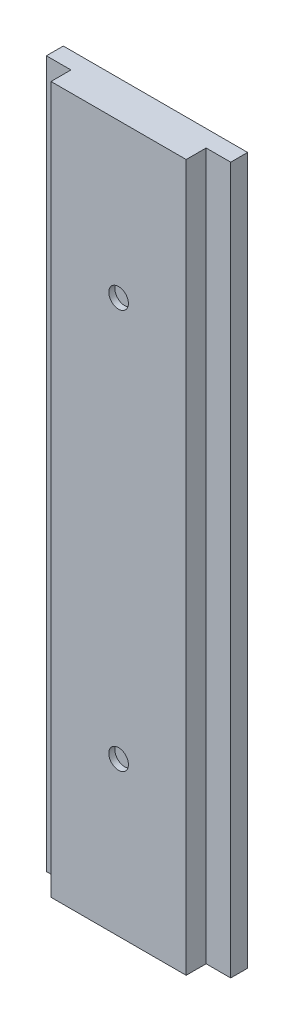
ISO-10303-21;
HEADER;
FILE_DESCRIPTION(('STEP AP214'),'2;1');
FILE_NAME('part.step','',(''),(''),'','','');
FILE_SCHEMA(('AUTOMOTIVE_DESIGN { 1 0 10303 214 1 1 1 1 }'));
ENDSEC;
DATA;
#1=APPLICATION_CONTEXT('core data for automotive mechanical design processes');
#2=APPLICATION_PROTOCOL_DEFINITION('international standard','automotive_design',2000,#1);
#3=PRODUCT_CONTEXT('',#1,'mechanical');
#4=PRODUCT('Part','Part','',(#3));
#5=PRODUCT_RELATED_PRODUCT_CATEGORY('part','',(#4));
#6=PRODUCT_DEFINITION_FORMATION('','',#4);
#7=PRODUCT_DEFINITION_CONTEXT('part definition',#1,'design');
#8=PRODUCT_DEFINITION('design','',#6,#7);
#9=PRODUCT_DEFINITION_SHAPE('','',#8);
#10=(LENGTH_UNIT() NAMED_UNIT(*) SI_UNIT(.MILLI.,.METRE.));
#11=(NAMED_UNIT(*) PLANE_ANGLE_UNIT() SI_UNIT($,.RADIAN.));
#12=(NAMED_UNIT(*) SI_UNIT($,.STERADIAN.) SOLID_ANGLE_UNIT());
#13=UNCERTAINTY_MEASURE_WITH_UNIT(LENGTH_MEASURE(1.E-05),#10,'distance_accuracy_value','');
#14=(GEOMETRIC_REPRESENTATION_CONTEXT(3) GLOBAL_UNCERTAINTY_ASSIGNED_CONTEXT((#13)) GLOBAL_UNIT_ASSIGNED_CONTEXT((#10,
#11,#12)) REPRESENTATION_CONTEXT('',''));
#15=CARTESIAN_POINT('',(0.,0.,0.));
#16=DIRECTION('',(0.,0.,1.));
#17=DIRECTION('',(1.,0.,0.));
#18=AXIS2_PLACEMENT_3D('',#15,#16,#17);
#19=CARTESIAN_POINT('',(20.,40.,6.));
#20=DIRECTION('',(1.,0.,0.));
#21=DIRECTION('',(0.,1.,0.));
#22=AXIS2_PLACEMENT_3D('',#19,#20,#21);
#23=PLANE('',#22);
#24=DIRECTION('',(0.,-1.,0.));
#25=VECTOR('',#24,1.);
#26=CARTESIAN_POINT('',(20.,40.,2.75));
#27=LINE('',#26,#25);
#28=CARTESIAN_POINT('',(20.,40.,2.75));
#29=VERTEX_POINT('',#28);
#30=CARTESIAN_POINT('',(20.,-75.,2.75));
#31=VERTEX_POINT('',#30);
#32=EDGE_CURVE('E152',#29,#31,#27,.T.);
#33=ORIENTED_EDGE('',*,*,#32,.F.);
#34=DIRECTION('',(0.,0.,-1.));
#35=VECTOR('',#34,1.);
#36=CARTESIAN_POINT('',(20.,40.,6.));
#37=LINE('',#36,#35);
#38=CARTESIAN_POINT('',(20.,40.,0.));
#39=VERTEX_POINT('',#38);
#40=EDGE_CURVE('E111',#29,#39,#37,.T.);
#41=ORIENTED_EDGE('',*,*,#40,.T.);
#42=DIRECTION('',(0.,-1.,0.));
#43=VECTOR('',#42,1.);
#44=CARTESIAN_POINT('',(20.,40.,0.));
#45=LINE('',#44,#43);
#46=CARTESIAN_POINT('',(20.,-75.,0.));
#47=VERTEX_POINT('',#46);
#48=EDGE_CURVE('E135',#39,#47,#45,.T.);
#49=ORIENTED_EDGE('',*,*,#48,.T.);
#50=DIRECTION('',(0.,0.,-1.));
#51=VECTOR('',#50,1.);
#52=CARTESIAN_POINT('',(20.,-75.,6.));
#53=LINE('',#52,#51);
#54=EDGE_CURVE('E11',#31,#47,#53,.T.);
#55=ORIENTED_EDGE('',*,*,#54,.F.);
#56=EDGE_LOOP('',(#33,#41,#49,#55));
#57=FACE_BOUND('',#56,.T.);
#58=ADVANCED_FACE('F26',(#57),#23,.F.);
#59=CARTESIAN_POINT('',(20.,-75.,6.));
#60=DIRECTION('',(0.,1.,0.));
#61=DIRECTION('',(0.,0.,1.));
#62=AXIS2_PLACEMENT_3D('',#59,#60,#61);
#63=PLANE('',#62);
#64=DIRECTION('',(1.,0.,0.));
#65=VECTOR('',#64,1.);
#66=CARTESIAN_POINT('',(50.,-75.,2.75));
#67=LINE('',#66,#65);
#68=CARTESIAN_POINT('',(46.,-75.,2.75));
#69=VERTEX_POINT('',#68);
#70=CARTESIAN_POINT('',(50.,-75.,2.75));
#71=VERTEX_POINT('',#70);
#72=EDGE_CURVE('E104',#69,#71,#67,.T.);
#73=ORIENTED_EDGE('',*,*,#72,.F.);
#74=DIRECTION('',(0.,0.,1.));
#75=VECTOR('',#74,1.);
#76=CARTESIAN_POINT('',(46.,-75.,2.75));
#77=LINE('',#76,#75);
#78=CARTESIAN_POINT('',(46.,-75.,6.));
#79=VERTEX_POINT('',#78);
#80=EDGE_CURVE('E90',#69,#79,#77,.T.);
#81=ORIENTED_EDGE('',*,*,#80,.T.);
#82=DIRECTION('',(1.,0.,0.));
#83=VECTOR('',#82,1.);
#84=CARTESIAN_POINT('',(20.,-75.,6.));
#85=LINE('',#84,#83);
#86=CARTESIAN_POINT('',(24.,-75.,6.));
#87=VERTEX_POINT('',#86);
#88=EDGE_CURVE('E102',#87,#79,#85,.T.);
#89=ORIENTED_EDGE('',*,*,#88,.F.);
#90=DIRECTION('',(0.,0.,1.));
#91=VECTOR('',#90,1.);
#92=CARTESIAN_POINT('',(24.,-75.,2.75));
#93=LINE('',#92,#91);
#94=CARTESIAN_POINT('',(24.,-75.,2.75));
#95=VERTEX_POINT('',#94);
#96=EDGE_CURVE('E48',#95,#87,#93,.T.);
#97=ORIENTED_EDGE('',*,*,#96,.F.);
#98=DIRECTION('',(1.,0.,0.));
#99=VECTOR('',#98,1.);
#100=CARTESIAN_POINT('',(20.,-75.,2.75));
#101=LINE('',#100,#99);
#102=EDGE_CURVE('E149',#31,#95,#101,.T.);
#103=ORIENTED_EDGE('',*,*,#102,.F.);
#104=ORIENTED_EDGE('',*,*,#54,.T.);
#105=DIRECTION('',(1.,0.,0.));
#106=VECTOR('',#105,1.);
#107=CARTESIAN_POINT('',(20.,-75.,0.));
#108=LINE('',#107,#106);
#109=CARTESIAN_POINT('',(50.,-75.,0.));
#110=VERTEX_POINT('',#109);
#111=EDGE_CURVE('E129',#47,#110,#108,.T.);
#112=ORIENTED_EDGE('',*,*,#111,.T.);
#113=DIRECTION('',(0.,0.,-1.));
#114=VECTOR('',#113,1.);
#115=CARTESIAN_POINT('',(50.,-75.,6.));
#116=LINE('',#115,#114);
#117=EDGE_CURVE('E33',#71,#110,#116,.T.);
#118=ORIENTED_EDGE('',*,*,#117,.F.);
#119=EDGE_LOOP('',(#73,#81,#89,#97,#103,#104,#112,#118));
#120=FACE_BOUND('',#119,.T.);
#121=ADVANCED_FACE('F101',(#120),#63,.F.);
#122=CARTESIAN_POINT('',(50.,40.,6.));
#123=DIRECTION('',(-1.,0.,0.));
#124=DIRECTION('',(0.,-1.,0.));
#125=AXIS2_PLACEMENT_3D('',#122,#123,#124);
#126=PLANE('',#125);
#127=DIRECTION('',(0.,0.,-1.));
#128=VECTOR('',#127,1.);
#129=CARTESIAN_POINT('',(50.,40.,6.));
#130=LINE('',#129,#128);
#131=CARTESIAN_POINT('',(50.,40.,2.75));
#132=VERTEX_POINT('',#131);
#133=CARTESIAN_POINT('',(50.,40.,0.));
#134=VERTEX_POINT('',#133);
#135=EDGE_CURVE('E119',#132,#134,#130,.T.);
#136=ORIENTED_EDGE('',*,*,#135,.F.);
#137=DIRECTION('',(0.,1.,0.));
#138=VECTOR('',#137,1.);
#139=CARTESIAN_POINT('',(50.,40.,2.75));
#140=LINE('',#139,#138);
#141=EDGE_CURVE('E95',#71,#132,#140,.T.);
#142=ORIENTED_EDGE('',*,*,#141,.F.);
#143=ORIENTED_EDGE('',*,*,#117,.T.);
#144=DIRECTION('',(0.,1.,0.));
#145=VECTOR('',#144,1.);
#146=CARTESIAN_POINT('',(50.,40.,0.));
#147=LINE('',#146,#145);
#148=EDGE_CURVE('E114',#110,#134,#147,.T.);
#149=ORIENTED_EDGE('',*,*,#148,.T.);
#150=EDGE_LOOP('',(#136,#142,#143,#149));
#151=FACE_BOUND('',#150,.T.);
#152=ADVANCED_FACE('F125',(#151),#126,.F.);
#153=CARTESIAN_POINT('',(20.,40.,6.));
#154=DIRECTION('',(0.,-1.,0.));
#155=DIRECTION('',(0.,0.,-1.));
#156=AXIS2_PLACEMENT_3D('',#153,#154,#155);
#157=PLANE('',#156);
#158=DIRECTION('',(-1.,0.,0.));
#159=VECTOR('',#158,1.);
#160=CARTESIAN_POINT('',(20.,40.,6.));
#161=LINE('',#160,#159);
#162=CARTESIAN_POINT('',(46.,40.,6.));
#163=VERTEX_POINT('',#162);
#164=CARTESIAN_POINT('',(24.,40.,6.));
#165=VERTEX_POINT('',#164);
#166=EDGE_CURVE('E108',#163,#165,#161,.T.);
#167=ORIENTED_EDGE('',*,*,#166,.F.);
#168=DIRECTION('',(0.,0.,1.));
#169=VECTOR('',#168,1.);
#170=CARTESIAN_POINT('',(46.,40.,2.75));
#171=LINE('',#170,#169);
#172=CARTESIAN_POINT('',(46.,40.,2.75));
#173=VERTEX_POINT('',#172);
#174=EDGE_CURVE('E40',#173,#163,#171,.T.);
#175=ORIENTED_EDGE('',*,*,#174,.F.);
#176=DIRECTION('',(-1.,0.,0.));
#177=VECTOR('',#176,1.);
#178=CARTESIAN_POINT('',(50.,40.,2.75));
#179=LINE('',#178,#177);
#180=EDGE_CURVE('E159',#132,#173,#179,.T.);
#181=ORIENTED_EDGE('',*,*,#180,.F.);
#182=ORIENTED_EDGE('',*,*,#135,.T.);
#183=DIRECTION('',(-1.,0.,0.));
#184=VECTOR('',#183,1.);
#185=CARTESIAN_POINT('',(20.,40.,0.));
#186=LINE('',#185,#184);
#187=EDGE_CURVE('E109',#134,#39,#186,.T.);
#188=ORIENTED_EDGE('',*,*,#187,.T.);
#189=ORIENTED_EDGE('',*,*,#40,.F.);
#190=DIRECTION('',(-1.,0.,0.));
#191=VECTOR('',#190,1.);
#192=CARTESIAN_POINT('',(20.,40.,2.75));
#193=LINE('',#192,#191);
#194=CARTESIAN_POINT('',(24.,40.,2.75));
#195=VERTEX_POINT('',#194);
#196=EDGE_CURVE('E142',#195,#29,#193,.T.);
#197=ORIENTED_EDGE('',*,*,#196,.F.);
#198=DIRECTION('',(0.,0.,1.));
#199=VECTOR('',#198,1.);
#200=CARTESIAN_POINT('',(24.,40.,2.75));
#201=LINE('',#200,#199);
#202=EDGE_CURVE('E140',#195,#165,#201,.T.);
#203=ORIENTED_EDGE('',*,*,#202,.T.);
#204=EDGE_LOOP('',(#167,#175,#181,#182,#188,#189,#197,#203));
#205=FACE_BOUND('',#204,.T.);
#206=ADVANCED_FACE('F179',(#205),#157,.F.);
#207=CARTESIAN_POINT('',(20.,40.,6.));
#208=DIRECTION('',(0.,0.,1.));
#209=DIRECTION('',(1.,0.,0.));
#210=AXIS2_PLACEMENT_3D('',#207,#208,#209);
#211=PLANE('',#210);
#212=CARTESIAN_POINT('',(35.,-50.,6.));
#213=DIRECTION('',(0.,0.,1.));
#214=DIRECTION('',(1.,0.,0.));
#215=AXIS2_PLACEMENT_3D('',#212,#213,#214);
#216=CIRCLE('',#215,1.6);
#217=CARTESIAN_POINT('',(36.6,-50.,6.));
#218=VERTEX_POINT('',#217);
#219=EDGE_CURVE('E171',#218,#218,#216,.T.);
#220=ORIENTED_EDGE('',*,*,#219,.F.);
#221=EDGE_LOOP('',(#220));
#222=FACE_BOUND('',#221,.T.);
#223=CARTESIAN_POINT('',(35.,15.,6.));
#224=DIRECTION('',(0.,0.,1.));
#225=DIRECTION('',(1.,0.,0.));
#226=AXIS2_PLACEMENT_3D('',#223,#224,#225);
#227=CIRCLE('',#226,1.6);
#228=CARTESIAN_POINT('',(36.6,15.,6.));
#229=VERTEX_POINT('',#228);
#230=EDGE_CURVE('E165',#229,#229,#227,.T.);
#231=ORIENTED_EDGE('',*,*,#230,.F.);
#232=EDGE_LOOP('',(#231));
#233=FACE_BOUND('',#232,.T.);
#234=DIRECTION('',(0.,-1.,0.));
#235=VECTOR('',#234,1.);
#236=CARTESIAN_POINT('',(46.,40.,6.));
#237=LINE('',#236,#235);
#238=EDGE_CURVE('E87',#163,#79,#237,.T.);
#239=ORIENTED_EDGE('',*,*,#238,.F.);
#240=ORIENTED_EDGE('',*,*,#166,.T.);
#241=DIRECTION('',(0.,1.,0.));
#242=VECTOR('',#241,1.);
#243=CARTESIAN_POINT('',(24.,40.,6.));
#244=LINE('',#243,#242);
#245=EDGE_CURVE('E105',#87,#165,#244,.T.);
#246=ORIENTED_EDGE('',*,*,#245,.F.);
#247=ORIENTED_EDGE('',*,*,#88,.T.);
#248=EDGE_LOOP('',(#239,#240,#246,#247));
#249=FACE_BOUND('',#248,.T.);
#250=ADVANCED_FACE('F107',(#222,#233,#249),#211,.T.);
#251=CARTESIAN_POINT('',(20.,40.,0.));
#252=DIRECTION('',(0.,0.,1.));
#253=DIRECTION('',(1.,0.,0.));
#254=AXIS2_PLACEMENT_3D('',#251,#252,#253);
#255=PLANE('',#254);
#256=ORIENTED_EDGE('',*,*,#48,.F.);
#257=ORIENTED_EDGE('',*,*,#187,.F.);
#258=ORIENTED_EDGE('',*,*,#148,.F.);
#259=ORIENTED_EDGE('',*,*,#111,.F.);
#260=EDGE_LOOP('',(#256,#257,#258,#259));
#261=FACE_BOUND('',#260,.T.);
#262=ADVANCED_FACE('F137',(#261),#255,.F.);
#263=CARTESIAN_POINT('',(24.,40.,2.75));
#264=DIRECTION('',(1.,0.,0.));
#265=DIRECTION('',(0.,1.,0.));
#266=AXIS2_PLACEMENT_3D('',#263,#264,#265);
#267=PLANE('',#266);
#268=ORIENTED_EDGE('',*,*,#245,.T.);
#269=ORIENTED_EDGE('',*,*,#202,.F.);
#270=DIRECTION('',(0.,1.,0.));
#271=VECTOR('',#270,1.);
#272=CARTESIAN_POINT('',(24.,40.,2.75));
#273=LINE('',#272,#271);
#274=EDGE_CURVE('E146',#95,#195,#273,.T.);
#275=ORIENTED_EDGE('',*,*,#274,.F.);
#276=ORIENTED_EDGE('',*,*,#96,.T.);
#277=EDGE_LOOP('',(#268,#269,#275,#276));
#278=FACE_BOUND('',#277,.T.);
#279=ADVANCED_FACE('F210',(#278),#267,.F.);
#280=CARTESIAN_POINT('',(20.,-75.,2.75));
#281=DIRECTION('',(0.,0.,1.));
#282=DIRECTION('',(1.,0.,0.));
#283=AXIS2_PLACEMENT_3D('',#280,#281,#282);
#284=PLANE('',#283);
#285=ORIENTED_EDGE('',*,*,#32,.T.);
#286=ORIENTED_EDGE('',*,*,#102,.T.);
#287=ORIENTED_EDGE('',*,*,#274,.T.);
#288=ORIENTED_EDGE('',*,*,#196,.T.);
#289=EDGE_LOOP('',(#285,#286,#287,#288));
#290=FACE_BOUND('',#289,.T.);
#291=ADVANCED_FACE('F211',(#290),#284,.T.);
#292=CARTESIAN_POINT('',(46.,40.,2.75));
#293=DIRECTION('',(-1.,0.,0.));
#294=DIRECTION('',(0.,-1.,0.));
#295=AXIS2_PLACEMENT_3D('',#292,#293,#294);
#296=PLANE('',#295);
#297=ORIENTED_EDGE('',*,*,#238,.T.);
#298=ORIENTED_EDGE('',*,*,#80,.F.);
#299=DIRECTION('',(0.,-1.,0.));
#300=VECTOR('',#299,1.);
#301=CARTESIAN_POINT('',(46.,40.,2.75));
#302=LINE('',#301,#300);
#303=EDGE_CURVE('E157',#173,#69,#302,.T.);
#304=ORIENTED_EDGE('',*,*,#303,.F.);
#305=ORIENTED_EDGE('',*,*,#174,.T.);
#306=EDGE_LOOP('',(#297,#298,#304,#305));
#307=FACE_BOUND('',#306,.T.);
#308=ADVANCED_FACE('F89',(#307),#296,.F.);
#309=CARTESIAN_POINT('',(50.,-75.,2.75));
#310=DIRECTION('',(0.,0.,-1.));
#311=DIRECTION('',(-1.,0.,0.));
#312=AXIS2_PLACEMENT_3D('',#309,#310,#311);
#313=PLANE('',#312);
#314=ORIENTED_EDGE('',*,*,#141,.T.);
#315=ORIENTED_EDGE('',*,*,#180,.T.);
#316=ORIENTED_EDGE('',*,*,#303,.T.);
#317=ORIENTED_EDGE('',*,*,#72,.T.);
#318=EDGE_LOOP('',(#314,#315,#316,#317));
#319=FACE_BOUND('',#318,.T.);
#320=ADVANCED_FACE('F186',(#319),#313,.F.);
#321=CARTESIAN_POINT('',(35.,15.,5.));
#322=DIRECTION('',(0.,0.,1.));
#323=DIRECTION('',(1.,0.,0.));
#324=AXIS2_PLACEMENT_3D('',#321,#322,#323);
#325=CYLINDRICAL_SURFACE('',#324,1.6);
#326=CARTESIAN_POINT('',(35.,15.,5.));
#327=DIRECTION('',(0.,0.,1.));
#328=DIRECTION('',(1.,0.,0.));
#329=AXIS2_PLACEMENT_3D('',#326,#327,#328);
#330=CIRCLE('',#329,1.6);
#331=CARTESIAN_POINT('',(36.6,15.,5.));
#332=VERTEX_POINT('',#331);
#333=EDGE_CURVE('E96',#332,#332,#330,.T.);
#334=ORIENTED_EDGE('',*,*,#333,.F.);
#335=EDGE_LOOP('',(#334));
#336=FACE_BOUND('',#335,.T.);
#337=ORIENTED_EDGE('',*,*,#230,.T.);
#338=EDGE_LOOP('',(#337));
#339=FACE_BOUND('',#338,.T.);
#340=ADVANCED_FACE('F183',(#336,#339),#325,.F.);
#341=CARTESIAN_POINT('',(35.,15.,5.));
#342=DIRECTION('',(0.,0.,1.));
#343=DIRECTION('',(1.,0.,0.));
#344=AXIS2_PLACEMENT_3D('',#341,#342,#343);
#345=PLANE('',#344);
#346=ORIENTED_EDGE('',*,*,#333,.T.);
#347=EDGE_LOOP('',(#346));
#348=FACE_BOUND('',#347,.T.);
#349=ADVANCED_FACE('F185',(#348),#345,.T.);
#350=CARTESIAN_POINT('',(35.,-50.,5.));
#351=DIRECTION('',(0.,0.,1.));
#352=DIRECTION('',(1.,0.,0.));
#353=AXIS2_PLACEMENT_3D('',#350,#351,#352);
#354=CYLINDRICAL_SURFACE('',#353,1.6);
#355=CARTESIAN_POINT('',(35.,-50.,5.));
#356=DIRECTION('',(0.,0.,1.));
#357=DIRECTION('',(1.,0.,0.));
#358=AXIS2_PLACEMENT_3D('',#355,#356,#357);
#359=CIRCLE('',#358,1.6);
#360=CARTESIAN_POINT('',(36.6,-50.,5.));
#361=VERTEX_POINT('',#360);
#362=EDGE_CURVE('E168',#361,#361,#359,.T.);
#363=ORIENTED_EDGE('',*,*,#362,.F.);
#364=EDGE_LOOP('',(#363));
#365=FACE_BOUND('',#364,.T.);
#366=ORIENTED_EDGE('',*,*,#219,.T.);
#367=EDGE_LOOP('',(#366));
#368=FACE_BOUND('',#367,.T.);
#369=ADVANCED_FACE('F175',(#365,#368),#354,.F.);
#370=CARTESIAN_POINT('',(35.,-50.,5.));
#371=DIRECTION('',(0.,0.,1.));
#372=DIRECTION('',(1.,0.,0.));
#373=AXIS2_PLACEMENT_3D('',#370,#371,#372);
#374=PLANE('',#373);
#375=ORIENTED_EDGE('',*,*,#362,.T.);
#376=EDGE_LOOP('',(#375));
#377=FACE_BOUND('',#376,.T.);
#378=ADVANCED_FACE('F264',(#377),#374,.T.);
#379=CLOSED_SHELL('',(#58,#121,#152,#206,#250,#262,#279,#291,#308,#320,#340,#349,#369,#378));
#380=MANIFOLD_SOLID_BREP('B2',#379);
#381=ADVANCED_BREP_SHAPE_REPRESENTATION('',(#18,#380),#14);
#382=SHAPE_DEFINITION_REPRESENTATION(#9,#381);
ENDSEC;
END-ISO-10303-21;
